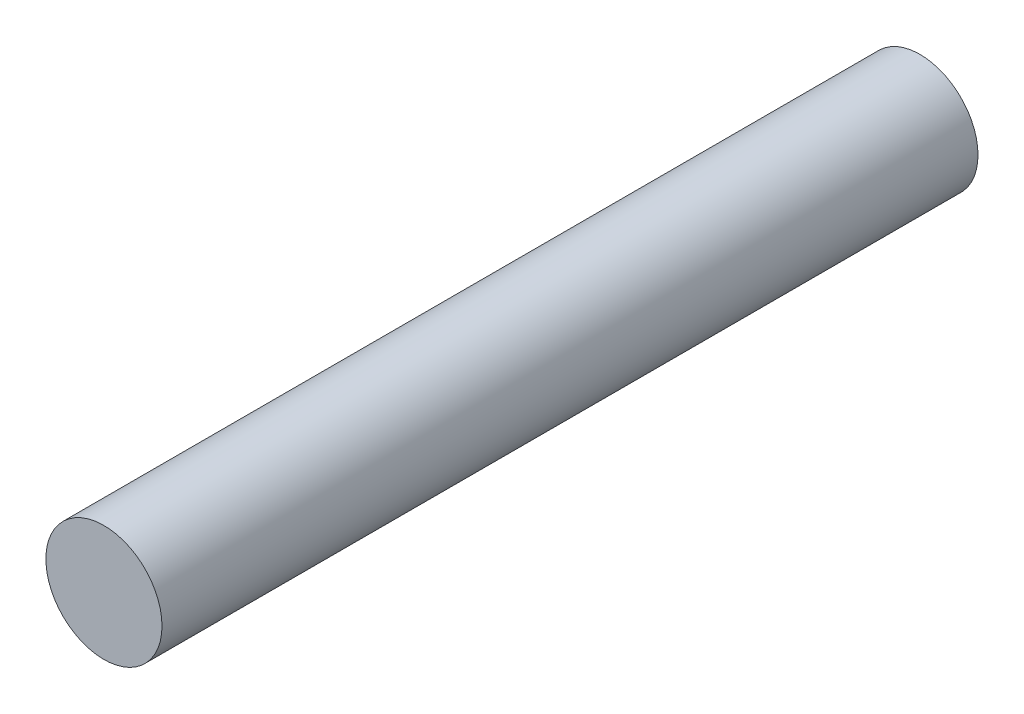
ISO-10303-21;
HEADER;
FILE_DESCRIPTION(('STEP AP214'),'2;1');
FILE_NAME('part.step','',(''),(''),'','','');
FILE_SCHEMA(('AUTOMOTIVE_DESIGN { 1 0 10303 214 1 1 1 1 }'));
ENDSEC;
DATA;
#1=APPLICATION_CONTEXT('core data for automotive mechanical design processes');
#2=APPLICATION_PROTOCOL_DEFINITION('international standard','automotive_design',2000,#1);
#3=PRODUCT_CONTEXT('',#1,'mechanical');
#4=PRODUCT('Part','Part','',(#3));
#5=PRODUCT_RELATED_PRODUCT_CATEGORY('part','',(#4));
#6=PRODUCT_DEFINITION_FORMATION('','',#4);
#7=PRODUCT_DEFINITION_CONTEXT('part definition',#1,'design');
#8=PRODUCT_DEFINITION('design','',#6,#7);
#9=PRODUCT_DEFINITION_SHAPE('','',#8);
#10=(LENGTH_UNIT() NAMED_UNIT(*) SI_UNIT(.MILLI.,.METRE.));
#11=(NAMED_UNIT(*) PLANE_ANGLE_UNIT() SI_UNIT($,.RADIAN.));
#12=(NAMED_UNIT(*) SI_UNIT($,.STERADIAN.) SOLID_ANGLE_UNIT());
#13=UNCERTAINTY_MEASURE_WITH_UNIT(LENGTH_MEASURE(1.E-05),#10,'distance_accuracy_value','');
#14=(GEOMETRIC_REPRESENTATION_CONTEXT(3) GLOBAL_UNCERTAINTY_ASSIGNED_CONTEXT((#13)) GLOBAL_UNIT_ASSIGNED_CONTEXT((#10,
#11,#12)) REPRESENTATION_CONTEXT('',''));
#15=CARTESIAN_POINT('',(0.,0.,0.));
#16=DIRECTION('',(0.,0.,1.));
#17=DIRECTION('',(1.,0.,0.));
#18=AXIS2_PLACEMENT_3D('',#15,#16,#17);
#19=CARTESIAN_POINT('',(-3.33066907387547E-13,-6.21724893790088E-12,246.000000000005));
#20=DIRECTION('',(0.,0.,-1.00000000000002));
#21=DIRECTION('',(-0.999999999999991,0.,0.));
#22=AXIS2_PLACEMENT_3D('',#19,#20,#21);
#23=CYLINDRICAL_SURFACE('',#22,35.);
#24=CARTESIAN_POINT('',(-3.33066907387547E-13,-6.21724893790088E-12,246.000000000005));
#25=DIRECTION('',(0.,0.,1.00000000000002));
#26=DIRECTION('',(0.999999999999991,0.,0.));
#27=AXIS2_PLACEMENT_3D('',#24,#25,#26);
#28=CIRCLE('',#27,35.);
#29=CARTESIAN_POINT('',(34.9999999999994,-6.23570639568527E-12,246.000000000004));
#30=VERTEX_POINT('',#29);
#31=EDGE_CURVE('E10',#30,#30,#28,.T.);
#32=ORIENTED_EDGE('',*,*,#31,.F.);
#33=EDGE_LOOP('',(#32));
#34=FACE_BOUND('',#33,.T.);
#35=CARTESIAN_POINT('',(3.24740234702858E-12,-3.5527136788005E-12,-246.000000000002));
#36=DIRECTION('',(0.,0.,1.00000000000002));
#37=DIRECTION('',(0.999999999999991,0.,0.));
#38=AXIS2_PLACEMENT_3D('',#35,#36,#37);
#39=CIRCLE('',#38,35.);
#40=CARTESIAN_POINT('',(35.0000000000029,-3.57117113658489E-12,-246.000000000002));
#41=VERTEX_POINT('',#40);
#42=EDGE_CURVE('E40',#41,#41,#39,.T.);
#43=ORIENTED_EDGE('',*,*,#42,.T.);
#44=EDGE_LOOP('',(#43));
#45=FACE_BOUND('',#44,.T.);
#46=ADVANCED_FACE('F34',(#34,#45),#23,.T.);
#47=CARTESIAN_POINT('',(-3.33066907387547E-13,-6.21724893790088E-12,246.000000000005));
#48=DIRECTION('',(0.,0.,1.00000000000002));
#49=DIRECTION('',(0.999999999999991,0.,0.));
#50=AXIS2_PLACEMENT_3D('',#47,#48,#49);
#51=PLANE('',#50);
#52=ORIENTED_EDGE('',*,*,#31,.T.);
#53=EDGE_LOOP('',(#52));
#54=FACE_BOUND('',#53,.T.);
#55=ADVANCED_FACE('F49',(#54),#51,.T.);
#56=CARTESIAN_POINT('',(3.24740234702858E-12,-3.5527136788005E-12,-246.000000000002));
#57=DIRECTION('',(0.,0.,1.00000000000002));
#58=DIRECTION('',(0.999999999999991,0.,0.));
#59=AXIS2_PLACEMENT_3D('',#56,#57,#58);
#60=PLANE('',#59);
#61=ORIENTED_EDGE('',*,*,#42,.F.);
#62=EDGE_LOOP('',(#61));
#63=FACE_BOUND('',#62,.T.);
#64=ADVANCED_FACE('F47',(#63),#60,.F.);
#65=CLOSED_SHELL('',(#46,#55,#64));
#66=MANIFOLD_SOLID_BREP('B2',#65);
#67=ADVANCED_BREP_SHAPE_REPRESENTATION('',(#18,#66),#14);
#68=SHAPE_DEFINITION_REPRESENTATION(#9,#67);
ENDSEC;
END-ISO-10303-21;
